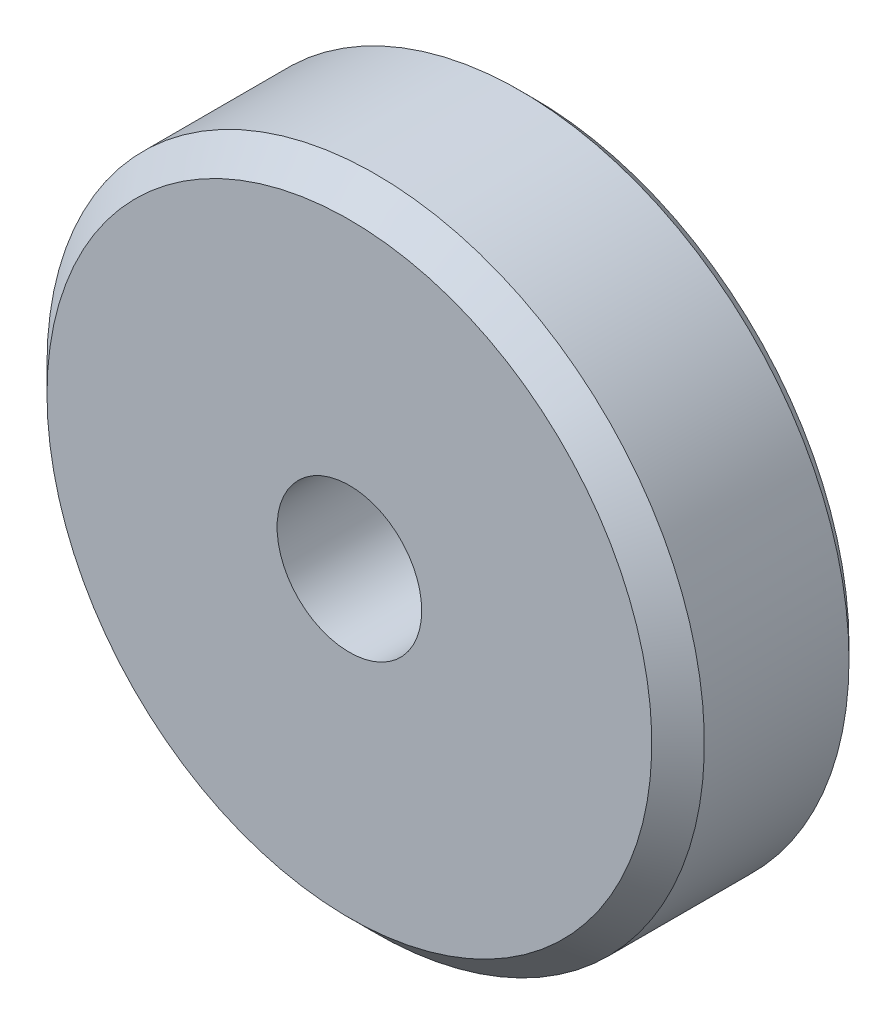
from build123d import *

# Parameters (mm, degrees)
ESQUISSE1_R                = 12.5
BASEEXTRUSION_DEPTH        = 7
CHANFREIN1_SIZE            = 1
ESQUISSE2_R                = 1.25
BOSSAGE_EXTRUSION1_DEPTH   = 6.25
ESQUISSE3_R                = 2.75
ENL_V_MAT_EXTRUSION1_DEPTH = 20.242141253
CHANFREIN2_SIZE            = 0.5


with BuildPart() as part:
    # Esquisse1 → BaseExtrusion (new body)
    with BuildSketch(Plane.XY):
        with Locations(Location((0, 0, 0), (0, 0, 180))):
            Circle(ESQUISSE1_R)
    extrude(amount=BASEEXTRUSION_DEPTH)

    # Chanfrein1
    chanfrein1_edges = [part.edges().sort_by_distance(p)[0] for p in [
        (12.5, 0, 7),
    ]]
    chamfer(chanfrein1_edges, length=CHANFREIN1_SIZE)

    # Esquisse2 → Bossage-Extrusion1 (add, symmetric)
    with BuildSketch(Plane(origin=(0, 0, 0), x_dir=(1, 0, 0), z_dir=(0, 1, 0))):
        with Locations((0, -0.65)):
            Circle(ESQUISSE2_R)
    extrude(amount=BOSSAGE_EXTRUSION1_DEPTH, both=True)

    # Esquisse3 → Enl_v. mat.-Extrusion1 (cut, through all)
    with BuildSketch(Plane.XY.offset(7)):
        Circle(ESQUISSE3_R)
    extrude(amount=-ENL_V_MAT_EXTRUSION1_DEPTH, mode=Mode.SUBTRACT)

    # Chanfrein2
    chanfrein2_edges = [part.edges().sort_by_distance(p)[0] for p in [
        (12.5, 0, 0),
    ]]
    chamfer(chanfrein2_edges, length=CHANFREIN2_SIZE)


solid = part.part
